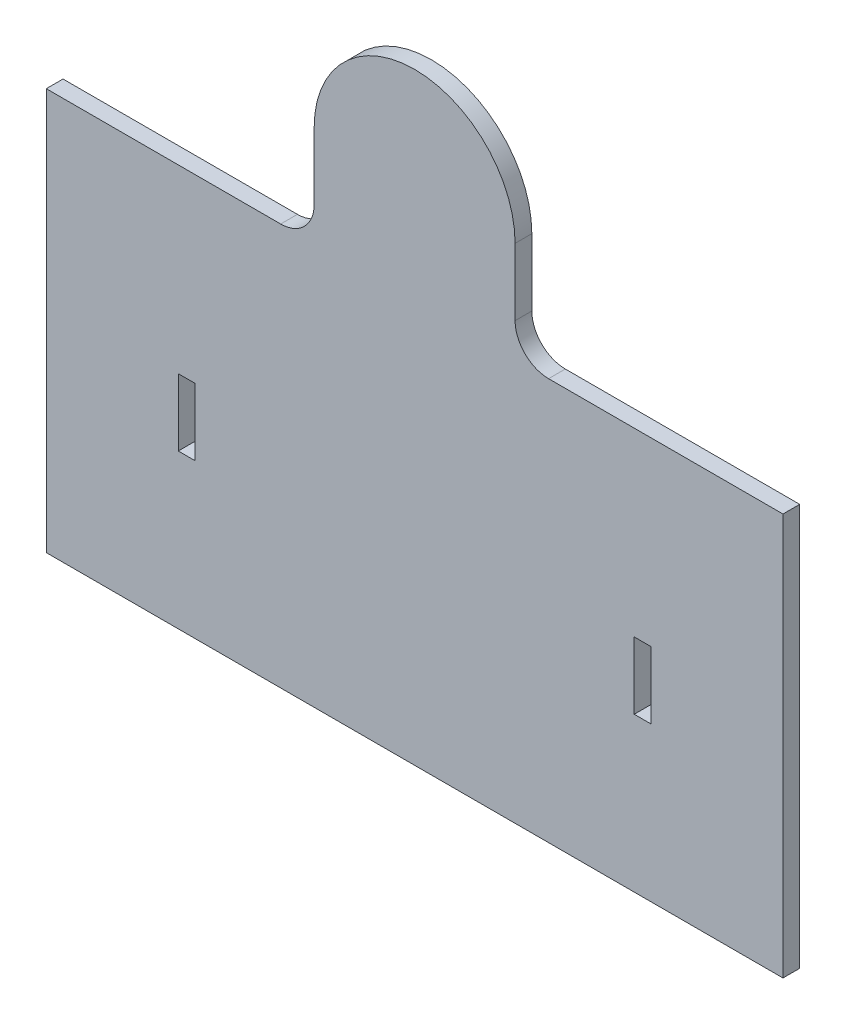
from build123d import *

# Parameters (mm, degrees)
BOSS_EXTRUDE1_DEPTH = 2.5
SKETCH2_W           = 2.5
SKETCH2_H           = 10
CUT_EXTRUDE1_DEPTH  = 2.5


with BuildPart() as part:
    # Sketch1 → Boss-Extrude1 (new body)
    with BuildSketch(Plane.XY):
        with BuildLine():
            Line((-52.79, 29.244541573), (-87.79, 29.244541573))
            Line((-87.79, 29.244541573), (-87.79, -30.755458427))
            Line((-87.79, -30.755458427), (22.21, -30.755458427))
            Line((22.21, -30.755458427), (22.21, 29.244541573))
            Line((22.21, 29.244541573), (-12.79, 29.244541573))
            ThreePointArc((-12.79, 29.244541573), (-16.325533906, 30.709007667), (-17.79, 34.244541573))
            Line((-17.79, 34.244541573), (-17.79, 44.244541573))
            ThreePointArc((-17.79, 44.244541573), (-32.79, 59.244541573), (-47.79, 44.244541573))
            Line((-47.79, 44.244541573), (-47.79, 34.244541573))
            ThreePointArc((-47.79, 34.244541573), (-49.254466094, 30.709007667), (-52.79, 29.244541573))
        make_face()
    extrude(amount=BOSS_EXTRUDE1_DEPTH)

    # Sketch2 → Cut-Extrude1 (cut)
    with BuildSketch(Plane.XY.offset(2.5)):
        with Locations((-66.83325996, -2.755458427)):
            Rectangle(SKETCH2_W, SKETCH2_H)
        with Locations((1.25, -2.755458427)):
            Rectangle(SKETCH2_W, SKETCH2_H)
    extrude(amount=-CUT_EXTRUDE1_DEPTH, mode=Mode.SUBTRACT)


solid = part.part
